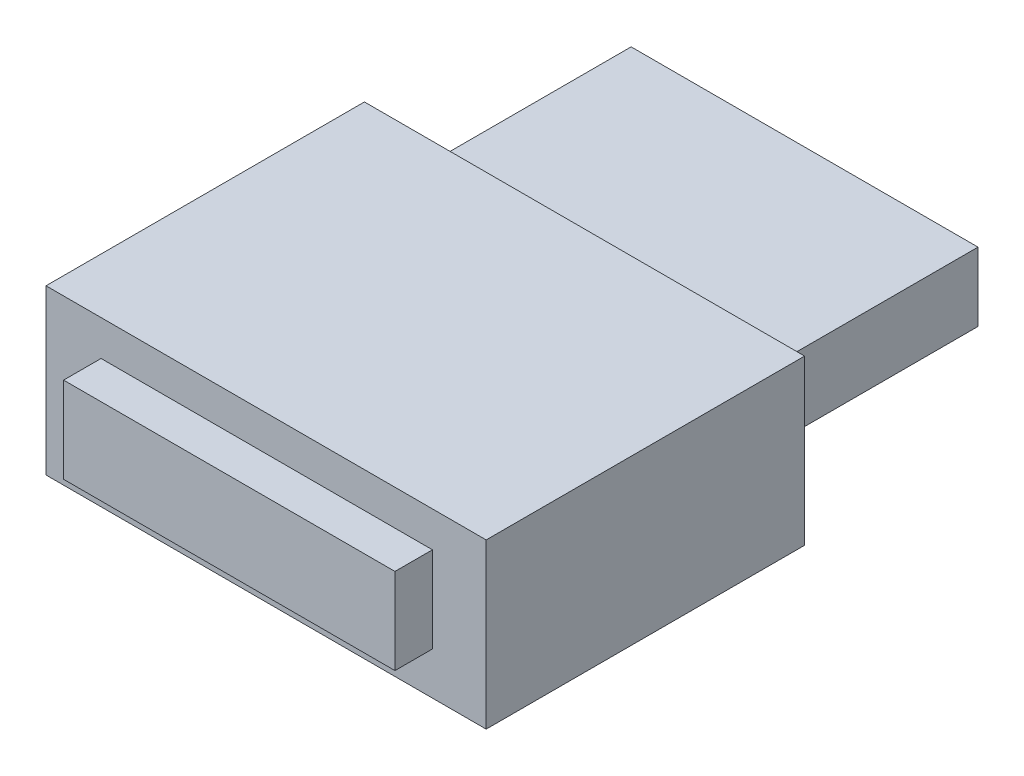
from build123d import *

# Parameters (mm, degrees)
SKETCH1_W      = 95.504
SKETCH1_H      = 69.088
EXTRUDE1_DEPTH = 35.56
SKETCH2_W      = 71.895339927
SKETCH2_H      = 18.637812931
EXTRUDE2_DEPTH = 8.128
SKETCH3_W      = 75.260369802
SKETCH3_H      = 14.911789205
EXTRUDE3_DEPTH = 50.8


with BuildPart() as part:
    # Sketch1 → Extrude1 (new body)
    with BuildSketch(Plane(origin=(0, 0, 0), x_dir=(1, 0, 0), z_dir=(0, 1, 0))):
        with Locations((-23.922635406, -4.883824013)):
            Rectangle(SKETCH1_W, SKETCH1_H)
    extrude(amount=EXTRUDE1_DEPTH)

    # Sketch2 → Extrude2 (add)
    with BuildSketch(Plane.XY.offset(39.427824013)):
        with Locations((-23.781569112, 18.552688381)):
            Rectangle(SKETCH2_W, SKETCH2_H)
    extrude(amount=EXTRUDE2_DEPTH)

    # Sketch3 → Extrude3 (add)
    with BuildSketch(Plane(origin=(0, 0, -29.660175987), x_dir=(-1, 0, 0), z_dir=(0, 0, -1))):
        with Locations((26.977851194, 16.588420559)):
            Rectangle(SKETCH3_W, SKETCH3_H)
    extrude(amount=EXTRUDE3_DEPTH)


solid = part.part
